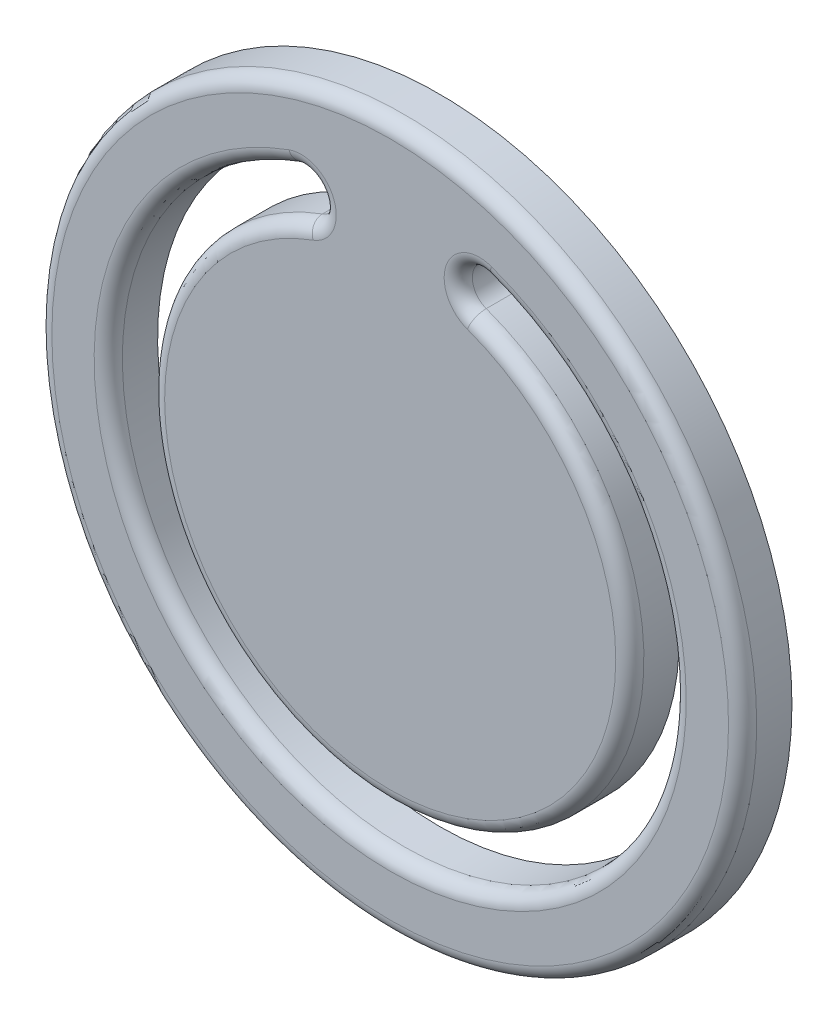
from build123d import *

# Parameters (mm, degrees)
SKIZZE1_R                    = 25
BASIS_LINEAR_AUSTRAGEN_DEPTH = 3.5
VERRUNDUNG1_R                = 1
VERRUNDUNG3_R                = 1


with BuildPart() as part:
    # Skizze1 → Basis-Linear austragen (new body)
    with BuildSketch(Plane.XY):
        Circle(SKIZZE1_R)
        with BuildLine():
            ThreePointArc((-6.840402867, 18.793852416), (0, -20), (6.840402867, 18.793852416))
            ThreePointArc((6.840402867, 18.793852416), (4.91783372, 17.8973437), (5.814342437, 15.974774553))
            ThreePointArc((5.814342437, 15.974774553), (0, -17), (-5.814342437, 15.974774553))
            ThreePointArc((-5.814342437, 15.974774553), (-4.91783372, 17.8973437), (-6.840402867, 18.793852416))
        make_face(mode=Mode.SUBTRACT)
    extrude(amount=BASIS_LINEAR_AUSTRAGEN_DEPTH)

    # Verrundung1
    verrundung1_edges = [part.edges().sort_by_distance(p)[0] for p in [
        (-25, 0, 3.5),
    ]]
    fillet(verrundung1_edges, radius=VERRUNDUNG1_R)

    # Verrundung3
    verrundung3_edges = [part.edges().sort_by_distance(p)[0] for p in [
        (0, -20, 3.5),
        (4.91783372, 17.8973437, 3.5),
        (0, -17, 3.5),
        (-4.91783372, 17.8973437, 3.5),
    ]]
    fillet(verrundung3_edges, radius=VERRUNDUNG3_R)


solid = part.part
